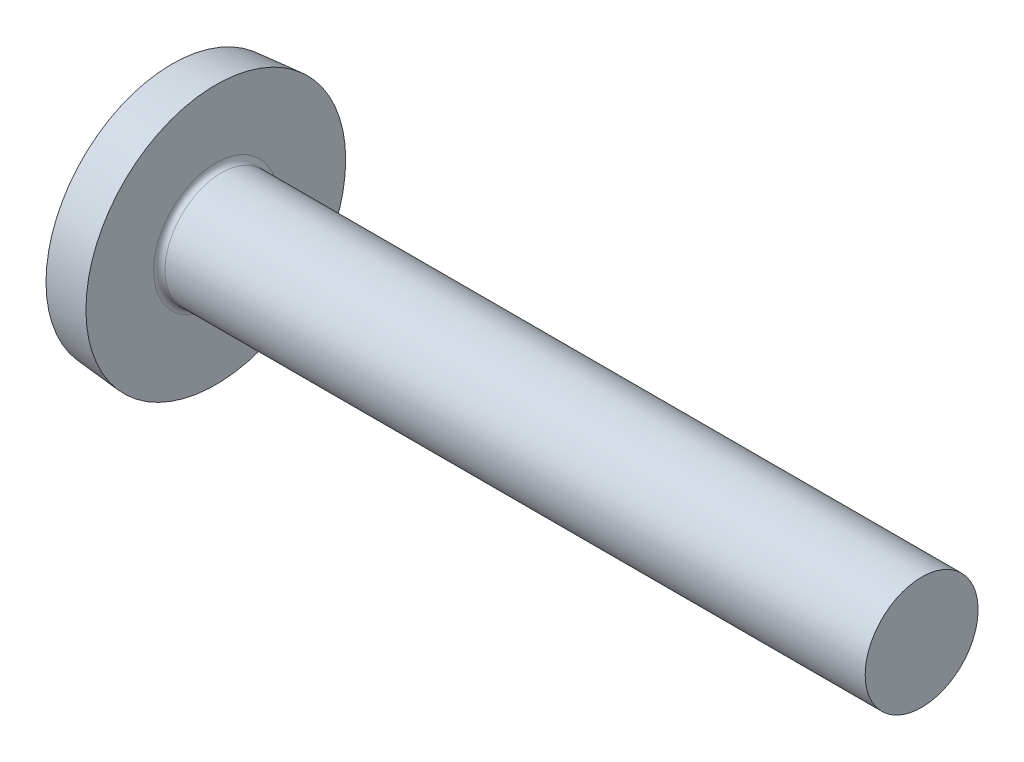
from build123d import *

# Parameters (mm, degrees)
FILLET1_R    = 0.4
RECPAT_COUNT = 2
RECPAT_ANGLE = 90


with BuildPart() as part:
    # BodySke → BaseBody (revolve)
    with BuildSketch(Plane.XY, mode=Mode.PRIVATE) as basebody_sk:
        with BuildLine():
            Line((4.8, 4), (4.8, 9.2))
            Line((4.8, 9.2), (1.7, 8.928785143))
            ThreePointArc((1.7, 8.928785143), (0.428783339, 4.544590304), (0, 0))
            Line((0, 0), (54.8, 0))
            Line((54.8, 0), (54.8, 4))
            Line((54.8, 4), (4.8, 4))
        make_face()
    revolve(basebody_sk.sketch.rotate(Axis((0, 0, 0), (1, 0, 0)), 90), axis=Axis((0, 0, 0), (1, 0, 0)))

    # Fillet1
    fillet1_edges = [part.edges().sort_by_distance(p)[0] for p in [
        (4.8, 0, -4),
    ]]
    fillet(fillet1_edges, radius=FILLET1_R)

    # RecSkeTop → Recess section 0
    with BuildSketch(Plane(origin=(0, 0, 0), x_dir=(0, 0, -1), z_dir=(1, 0, 0))):
        with BuildLine():
            Line((-0.858, 3.9), (0.858, 3.9))
            Line((0.858, 3.9), (0.858, -3.9))
            Line((0.858, -3.9), (-0.858, -3.9))
            Line((-0.858, -3.9), (-0.858, 3.9))
        make_face()
    # RecSkeBot → Recess section 1
    with BuildSketch(Plane(origin=(4.38, 0, 0), x_dir=(0, 0, -1), z_dir=(1, 0, 0))):
        with BuildLine():
            Line((-0.858, 1.716212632), (0.858, 1.716212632))
            Line((0.858, 1.716212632), (0.858, -1.716212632))
            Line((0.858, -1.716212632), (-0.858, -1.716212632))
            Line((-0.858, -1.716212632), (-0.858, 1.716212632))
        make_face()
    recess = loft(mode=Mode.SUBTRACT)

    # RecPat: Recess ×2 about axis
    recpat_axis = Axis((0, 0, 0), (1, 0, 0))
    for i in range(1, RECPAT_COUNT):
        add(recess.rotate(recpat_axis, i * RECPAT_ANGLE / (RECPAT_COUNT - 1)), mode=Mode.SUBTRACT)

    # RecCorSke → RecessCore (revolve, cut)
    with BuildSketch(Plane.XY, mode=Mode.PRIVATE) as recesscore_sk:
        Polygon((0, 0), (0, 1.8876), (4.38, 1.581320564), (4.893802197, 0), align=None)
    revolve(recesscore_sk.sketch.rotate(Axis((0, 0, 0), (1, 0, 0)), 12.896062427), axis=Axis((0, 0, 0), (1, 0, 0)), mode=Mode.SUBTRACT)


solid = part.part
